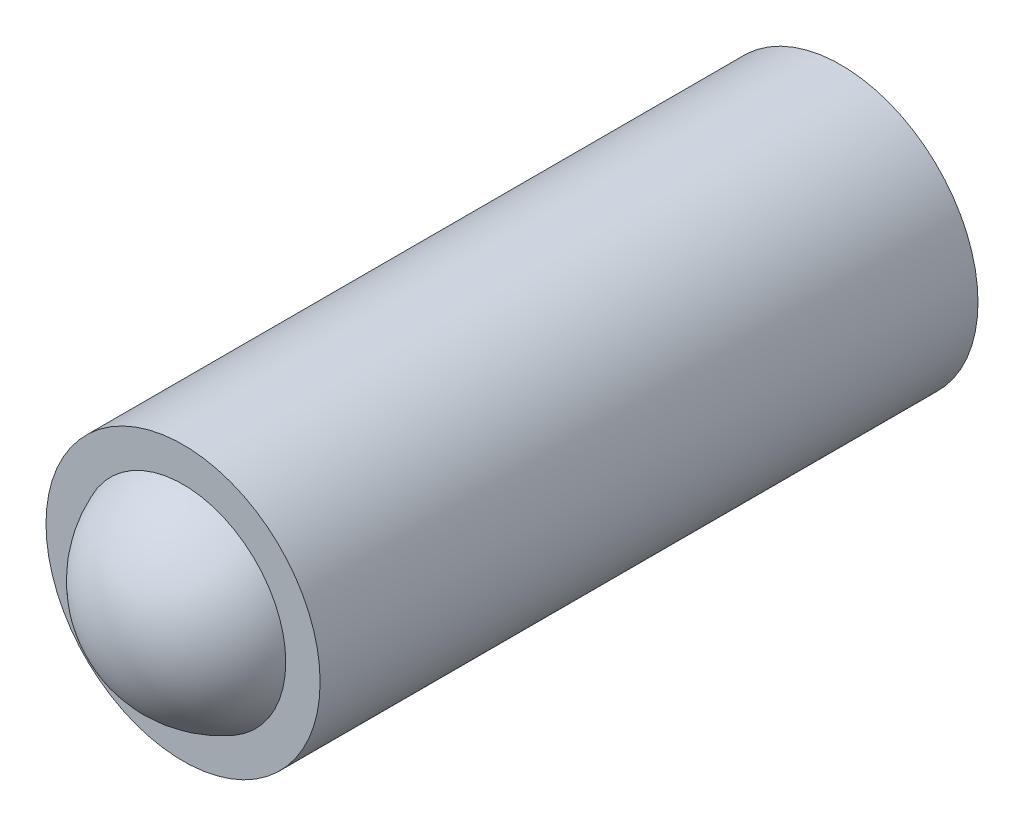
ISO-10303-21;
HEADER;
FILE_DESCRIPTION(('STEP AP214'),'2;1');
FILE_NAME('part.step','',(''),(''),'','','');
FILE_SCHEMA(('AUTOMOTIVE_DESIGN { 1 0 10303 214 1 1 1 1 }'));
ENDSEC;
DATA;
#1=APPLICATION_CONTEXT('core data for automotive mechanical design processes');
#2=APPLICATION_PROTOCOL_DEFINITION('international standard','automotive_design',2000,#1);
#3=PRODUCT_CONTEXT('',#1,'mechanical');
#4=PRODUCT('Part','Part','',(#3));
#5=PRODUCT_RELATED_PRODUCT_CATEGORY('part','',(#4));
#6=PRODUCT_DEFINITION_FORMATION('','',#4);
#7=PRODUCT_DEFINITION_CONTEXT('part definition',#1,'design');
#8=PRODUCT_DEFINITION('design','',#6,#7);
#9=PRODUCT_DEFINITION_SHAPE('','',#8);
#10=(LENGTH_UNIT() NAMED_UNIT(*) SI_UNIT(.MILLI.,.METRE.));
#11=(NAMED_UNIT(*) PLANE_ANGLE_UNIT() SI_UNIT($,.RADIAN.));
#12=(NAMED_UNIT(*) SI_UNIT($,.STERADIAN.) SOLID_ANGLE_UNIT());
#13=UNCERTAINTY_MEASURE_WITH_UNIT(LENGTH_MEASURE(1.E-05),#10,'distance_accuracy_value','');
#14=(GEOMETRIC_REPRESENTATION_CONTEXT(3) GLOBAL_UNCERTAINTY_ASSIGNED_CONTEXT((#13)) GLOBAL_UNIT_ASSIGNED_CONTEXT((#10,
#11,#12)) REPRESENTATION_CONTEXT('',''));
#15=CARTESIAN_POINT('',(0.,0.,0.));
#16=DIRECTION('',(0.,0.,1.));
#17=DIRECTION('',(1.,0.,0.));
#18=AXIS2_PLACEMENT_3D('',#15,#16,#17);
#19=CARTESIAN_POINT('',(0.,0.,4.98378822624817));
#20=DIRECTION('',(0.,0.,1.));
#21=DIRECTION('',(-1.,0.,0.));
#22=AXIS2_PLACEMENT_3D('',#19,#20,#21);
#23=CYLINDRICAL_SURFACE('',#22,1.25);
#24=CARTESIAN_POINT('',(0.,0.,-3.));
#25=DIRECTION('',(0.,0.,1.));
#26=DIRECTION('',(-1.,0.,0.));
#27=AXIS2_PLACEMENT_3D('',#24,#25,#26);
#28=CIRCLE('',#27,1.25);
#29=CARTESIAN_POINT('',(-1.25,0.,-3.));
#30=VERTEX_POINT('',#29);
#31=EDGE_CURVE('E8',#30,#30,#28,.T.);
#32=ORIENTED_EDGE('',*,*,#31,.T.);
#33=EDGE_LOOP('',(#32));
#34=FACE_BOUND('',#33,.T.);
#35=CARTESIAN_POINT('',(0.,0.,3.));
#36=DIRECTION('',(0.,0.,1.));
#37=DIRECTION('',(-1.,0.,0.));
#38=AXIS2_PLACEMENT_3D('',#35,#36,#37);
#39=CIRCLE('',#38,1.25);
#40=CARTESIAN_POINT('',(-1.25,0.,3.));
#41=VERTEX_POINT('',#40);
#42=EDGE_CURVE('E26',#41,#41,#39,.T.);
#43=ORIENTED_EDGE('',*,*,#42,.F.);
#44=EDGE_LOOP('',(#43));
#45=FACE_BOUND('',#44,.T.);
#46=ADVANCED_FACE('F12',(#34,#45),#23,.T.);
#47=CARTESIAN_POINT('',(-1.25,0.,-3.));
#48=DIRECTION('',(0.,0.,-1.));
#49=DIRECTION('',(1.,0.,0.));
#50=AXIS2_PLACEMENT_3D('',#47,#48,#49);
#51=PLANE('',#50);
#52=CARTESIAN_POINT('',(0.,0.,-3.));
#53=DIRECTION('',(0.,0.,1.));
#54=DIRECTION('',(-1.,0.,0.));
#55=AXIS2_PLACEMENT_3D('',#52,#53,#54);
#56=CIRCLE('',#55,0.936749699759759);
#57=CARTESIAN_POINT('',(-0.936749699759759,0.,-3.));
#58=VERTEX_POINT('',#57);
#59=EDGE_CURVE('E18',#58,#58,#56,.T.);
#60=ORIENTED_EDGE('',*,*,#59,.T.);
#61=EDGE_LOOP('',(#60));
#62=FACE_BOUND('',#61,.T.);
#63=ORIENTED_EDGE('',*,*,#31,.F.);
#64=EDGE_LOOP('',(#63));
#65=FACE_BOUND('',#64,.T.);
#66=ADVANCED_FACE('F36',(#62,#65),#51,.T.);
#67=CARTESIAN_POINT('',(0.,0.,-2.65));
#68=DIRECTION('',(0.,0.,1.));
#69=DIRECTION('',(-1.,0.,0.));
#70=AXIS2_PLACEMENT_3D('',#67,#68,#69);
#71=SPHERICAL_SURFACE('',#70,1.);
#72=ORIENTED_EDGE('',*,*,#59,.F.);
#73=EDGE_LOOP('',(#72));
#74=FACE_BOUND('',#73,.T.);
#75=ADVANCED_FACE('F41',(#74),#71,.T.);
#76=CARTESIAN_POINT('',(0.,0.,2.65));
#77=DIRECTION('',(0.,0.,1.));
#78=DIRECTION('',(1.,0.,0.));
#79=AXIS2_PLACEMENT_3D('',#76,#77,#78);
#80=SPHERICAL_SURFACE('',#79,1.);
#81=CARTESIAN_POINT('',(0.,0.,3.));
#82=DIRECTION('',(0.,0.,1.));
#83=DIRECTION('',(-1.,0.,0.));
#84=AXIS2_PLACEMENT_3D('',#81,#82,#83);
#85=CIRCLE('',#84,0.93674969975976);
#86=CARTESIAN_POINT('',(-0.93674969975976,0.,3.));
#87=VERTEX_POINT('',#86);
#88=EDGE_CURVE('E22',#87,#87,#85,.T.);
#89=ORIENTED_EDGE('',*,*,#88,.T.);
#90=EDGE_LOOP('',(#89));
#91=FACE_BOUND('',#90,.T.);
#92=ADVANCED_FACE('F45',(#91),#80,.T.);
#93=CARTESIAN_POINT('',(-1.25,0.,3.));
#94=DIRECTION('',(0.,0.,1.));
#95=DIRECTION('',(-1.,0.,0.));
#96=AXIS2_PLACEMENT_3D('',#93,#94,#95);
#97=PLANE('',#96);
#98=ORIENTED_EDGE('',*,*,#42,.T.);
#99=EDGE_LOOP('',(#98));
#100=FACE_BOUND('',#99,.T.);
#101=ORIENTED_EDGE('',*,*,#88,.F.);
#102=EDGE_LOOP('',(#101));
#103=FACE_BOUND('',#102,.T.);
#104=ADVANCED_FACE('F32',(#100,#103),#97,.T.);
#105=CLOSED_SHELL('',(#46,#66,#75,#92,#104));
#106=MANIFOLD_SOLID_BREP('B1',#105);
#107=ADVANCED_BREP_SHAPE_REPRESENTATION('',(#18,#106),#14);
#108=SHAPE_DEFINITION_REPRESENTATION(#9,#107);
ENDSEC;
END-ISO-10303-21;
